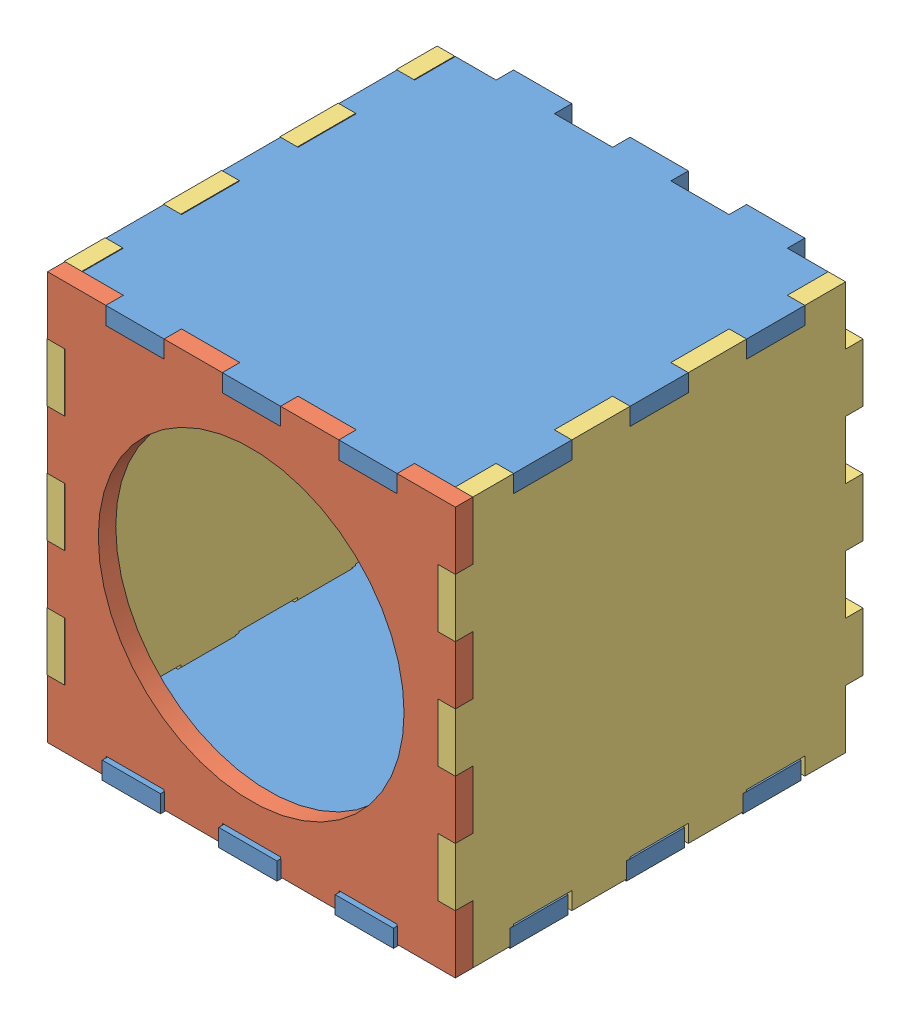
SolidWorks assembly pen_holder.SLDASM, configuration Default (file format 9000). Lengths in mm.
Overall size (70.15 70.26 70.65).
5 component instances, 3 part files, 8 mates.
Components (placement in the parent):
- Part2-1: Part2.SLDPRT [Default] at (-5.0591 27.8067 91.6268) x (0 0 -1) z (0 1 0) size (70 70 3)
- Part3-3: Part3.SLDPRT [Default] at (23.6294 17.61 88.6268) size (70 70 3)
- side_2-1: side_2.SLDPRT [Default] at (61.9409 -4.1933 56.6268) x (0 1 0) z (1 0 0) size (70 70 3)
- side_2-2: side_2.SLDPRT [Default] at (-5.1755 -4.1933 56.6268) x (0 1 0) z (1 0 0) size (70 70 3)
- Part2-4: Part2.SLDPRT [Default] at (-5.0288 -36.4567 92.2787) x (1 0 0) z (0 -1 0) size (70 70 3)
Mates (geometry in assembly coordinates):
- Coincident8: coincident aligned: plane of Part2-1 through (-5.0591 30.8067 91.6268) normal (0 0 1); plane of Part3-3 through (23.6294 17.61 91.6268) normal (0 0 1)
- Coincident9: coincident aligned: plane of Part2-1 through (-5.0591 30.8067 91.6268) normal (0 1 0); plane of Part3-3 through (-5.0591 30.8067 91.6268) normal (0 1 0)
- Coincident13: coincident aligned: plane of Part2-1 through (64.9409 30.8067 91.6268) normal (1 0 0); plane of Part3-3 through (64.9409 30.8067 91.6268) normal (1 0 0)
- Coincident16: coincident aligned: plane of Part2-1 through (-5.0591 30.8067 91.6268) normal (0 1 0); plane of side_2-1 through (64.9409 30.8067 91.6268) normal (0 1 0)
- Coincident18: coincident aligned: plane of Part2-1 through (64.9409 30.8067 91.6268) normal (1 0 0); plane of side_2-1 through (64.9409 -4.1933 56.6268) normal (1 0 0)
- Coincident19: coincident aligned: plane of Part3-3 through (23.6294 17.61 91.6268) normal (0 0 1); plane of side_2-1 through (64.9409 30.8067 91.6268) normal (0 0 1)
- Coincident39: coincident aligned: plane of Part3-3 through (23.6294 17.61 91.6268) normal (0 0 1); plane of side_2-2 through (-2.1755 30.8067 91.6268) normal (0 0 1)
- Coincident40: coincident aligned: plane of Part2-1 through (-5.0591 30.8067 91.6268) normal (0 1 0); plane of side_2-2 through (-2.1755 30.8067 91.6268) normal (0 1 0)
